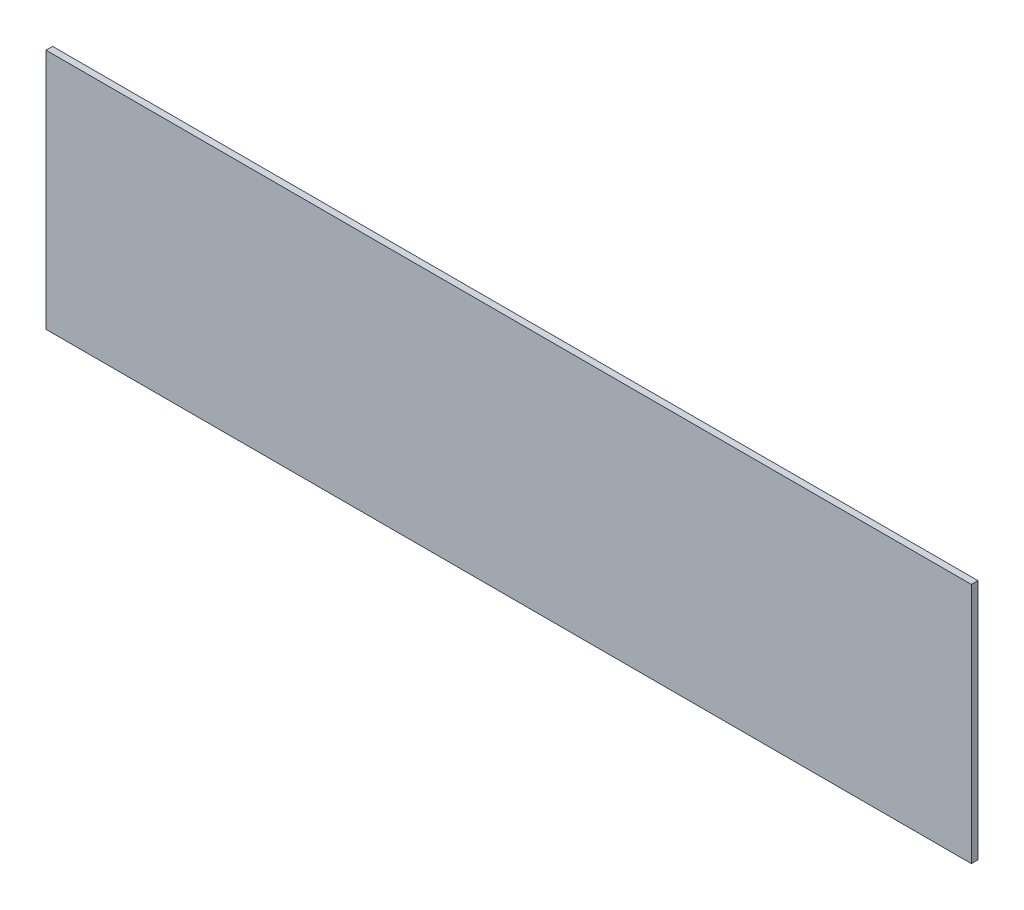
from build123d import *

# Parameters (mm, degrees)
SKETCH1_W           = 421
SKETCH1_H           = 110
BOSS_EXTRUDE1_DEPTH = 3


with BuildPart() as part:
    # Sketch1 → Boss-Extrude1 (new body)
    with BuildSketch(Plane.XY):
        with Locations((210.5, 55)):
            Rectangle(SKETCH1_W, SKETCH1_H)
    extrude(amount=BOSS_EXTRUDE1_DEPTH)


solid = part.part
